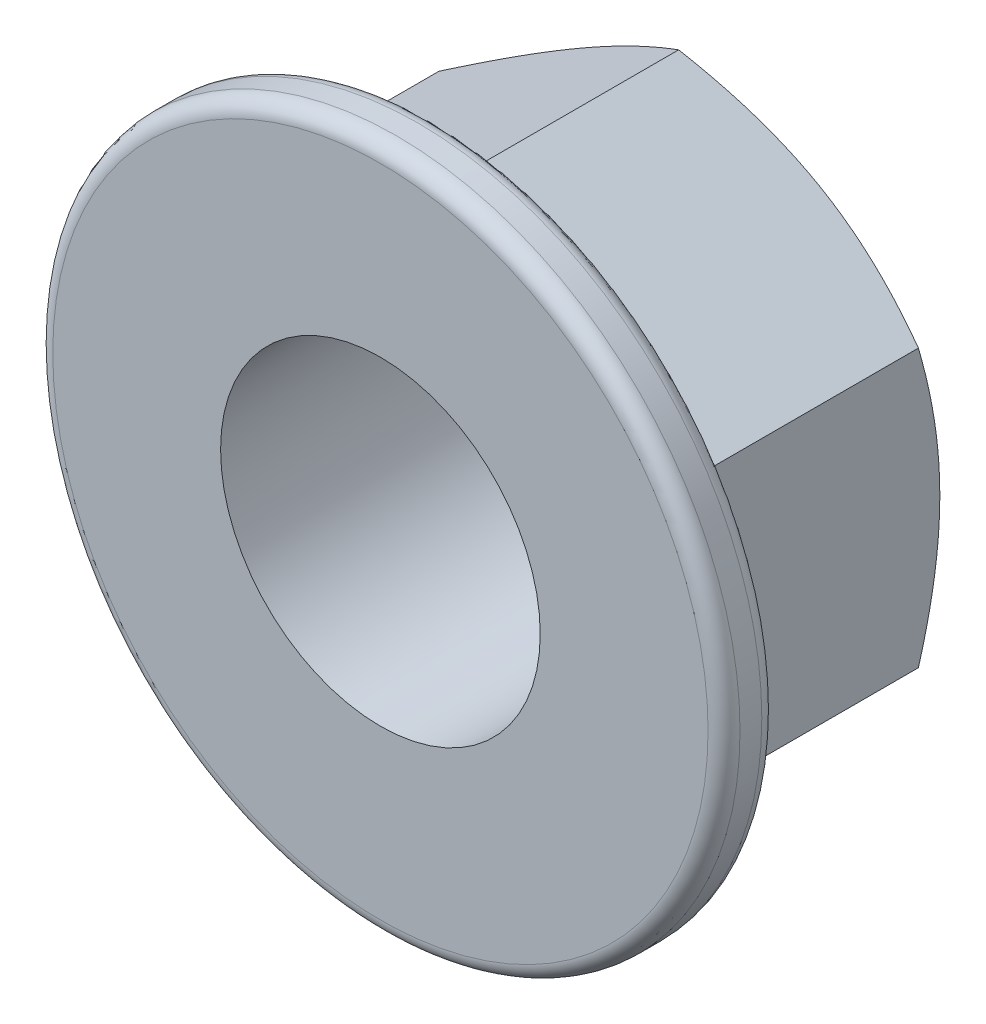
from build123d import *

# Parameters (mm, degrees)
BASE_EXTRUSION_DEPTH    = 20
ESQUISSE3_R             = 10
ENL_V_MAT_EXTRU_1_DEPTH = 31.413812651


with BuildPart() as part:
    # Esquisse1 → Base-Extrusion (new body)
    with BuildSketch(Plane.XY):
        Polygon((15, -8.660254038), (15, 8.660254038), (0, 17.320508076), (-15, 8.660254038), (-15, -8.660254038), (0, -17.320508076), align=None)
    extrude(amount=-BASE_EXTRUSION_DEPTH)

    # Esquisse2 → Enl_vement de mati_re-R_volution1 (revolve, cut)
    with BuildSketch(Plane(origin=(0, 0, 0), x_dir=(1, 0, 0), z_dir=(0, 1, 0)), mode=Mode.PRIVATE) as enl_vement_de_mati_re_r_volution1_sk:
        Polygon((-15, 20), (-49.641016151, 20), (-49.641016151, 0), align=None)
    revolve(enl_vement_de_mati_re_r_volution1_sk.sketch.rotate(Axis((0, 0, -20), (0, 0, 1)), 180), axis=Axis((0, 0, -20), (0, 0, 1)), mode=Mode.SUBTRACT)

    # Esquisse3 → Enl_v. mat.-Extru.1 (cut, through all)
    with BuildSketch(Plane.XY):
        Circle(ESQUISSE3_R)
    extrude(amount=-ENL_V_MAT_EXTRU_1_DEPTH, mode=Mode.SUBTRACT)

    # Esquisse4 → Boss.-R_vol.1 (revolve)
    with BuildSketch(Plane(origin=(0, 0, 0), x_dir=(1, 0, 0), z_dir=(0, 1, 0)), mode=Mode.PRIVATE) as boss_r_vol_1_sk:
        with BuildLine():
            Line((-15, 0), (-20.5, 0))
            ThreePointArc((-20.5, 0), (-21.207106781, 0.292893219), (-21.5, 1))
            Line((-21.5, 1), (-21.5, 2.362929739))
            ThreePointArc((-21.5, 2.362929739), (-21.343391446, 2.900229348), (-20.922618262, 3.269237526))
            Line((-20.922618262, 3.269237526), (-15, 6.030999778))
            Line((-15, 6.030999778), (-15, 0))
        make_face()
    revolve(boss_r_vol_1_sk.sketch.rotate(Axis((0, 0, 0), (0, 0, -1)), 180), axis=Axis((0, 0, 0), (0, 0, -1)))


solid = part.part
